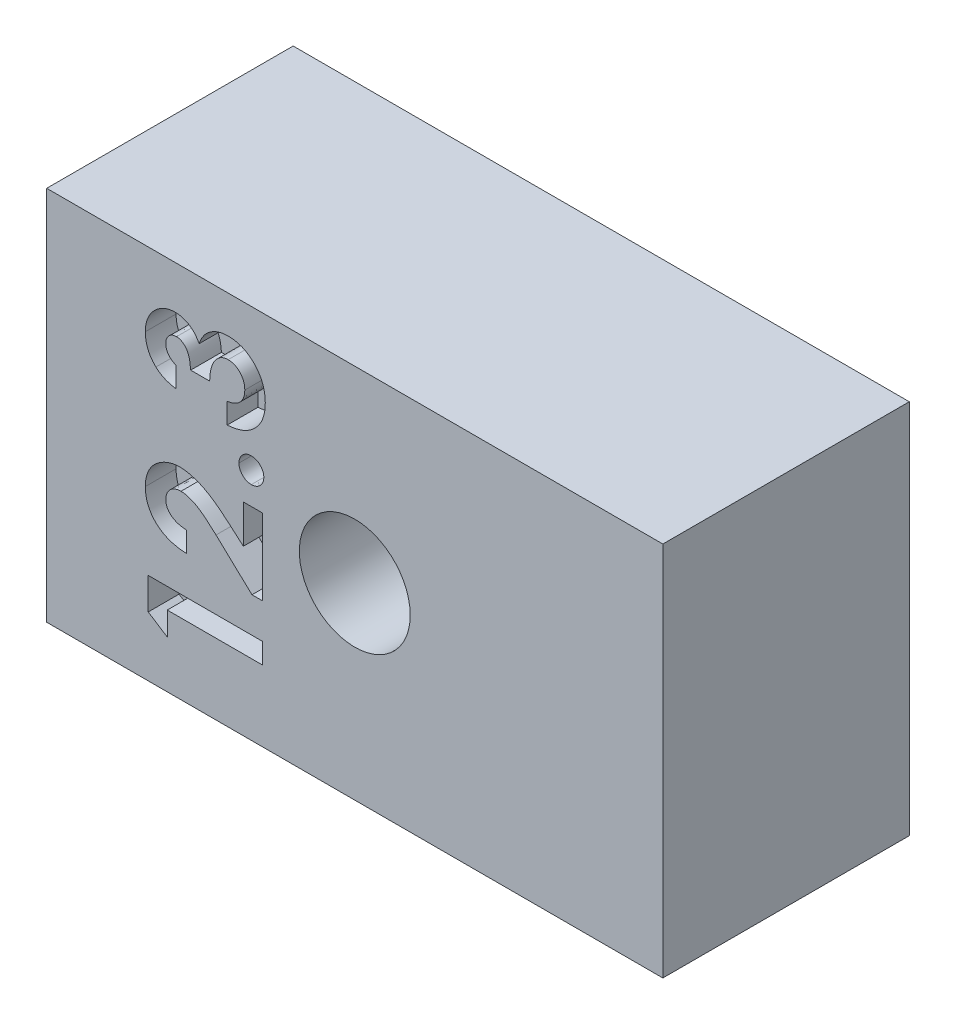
from build123d import *

# Parameters (mm, degrees)
SKETCH1_W           = 20
SKETCH1_H           = 12.2
SKETCH1_R           = 1.8
BOSS_EXTRUDE1_DEPTH = 8
CUT_EXTRUDE1_DEPTH  = 1


with BuildPart() as part:
    # Sketch1 → Boss-Extrude1 (new body)
    with BuildSketch(Plane.XY):
        with Locations((-2.245418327, 0.429083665)):
            Rectangle(SKETCH1_W, SKETCH1_H)
        with Locations((-2.245418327, 0.429083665)):
            Circle(SKETCH1_R, mode=Mode.SUBTRACT)
    extrude(amount=BOSS_EXTRUDE1_DEPTH)

    # Sketch3 → Cut-Extrude1 (cut)
    with BuildSketch(Plane.XY.offset(8)):
        Polygon((-8.949584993, -3.732909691), (-8.949584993, -2.705211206), (-5.245418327, -2.705211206), (-5.245418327, -3.370061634), (-8.332223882, -3.370061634), (-8.332223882, -4.129890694), align=None)
        with BuildLine():
            Line((-7.714862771, -0.805638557), (-7.714862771, -1.470488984))
            add(Edge.make_bspline(
                [(-7.714862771, -1.470488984), (-7.765155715, -1.467618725), (-7.863425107, -1.462010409), (-8.006155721, -1.439677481), (-8.141053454, -1.409829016), (-8.267712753, -1.369652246), (-8.38618683, -1.32016554), (-8.496083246, -1.260137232), (-8.59818946, -1.191359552), (-8.690714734, -1.112446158), (-8.773897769, -1.026599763), (-8.846618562, -0.934040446), (-8.907495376, -0.835031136), (-8.957432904, -0.730233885), (-8.997389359, -0.620060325), (-9.024089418, -0.503397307), (-9.042174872, -0.38127423), (-9.043757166, -0.297670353), (-9.044563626, -0.255059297)],
                knots=[0, 0, 0, 0, 1.198928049, 2.342633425, 3.435730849, 4.486331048, 5.502589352, 6.488331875, 7.46361919, 8.428949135, 9.378681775, 10.305958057, 11.226249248, 12.140413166, 13.066341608, 14.010670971, 14.986082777, 16, 16, 16, 16], degree=3))
            add(Edge.make_bspline(
                [(-9.044563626, -0.255059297), (-9.0430413, -0.202731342), (-9.040068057, -0.100530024), (-9.011353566, 0.04748298), (-8.967382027, 0.186458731), (-8.903497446, 0.314918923), (-8.822938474, 0.43264021), (-8.726698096, 0.538968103), (-8.613607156, 0.631828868), (-8.486922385, 0.710498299), (-8.352513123, 0.775553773), (-8.213782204, 0.821579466), (-8.07431021, 0.851672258), (-7.980407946, 0.854889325), (-7.933758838, 0.856487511)],
                knots=[0, 0, 0, 0, 1.075374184, 2.100304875, 3.089917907, 4.066149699, 5.039978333, 6.01615708, 7.006437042, 8.039858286, 9.077679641, 10.07047942, 11.041445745, 12, 12, 12, 12], degree=3))
            add(Edge.make_bspline(
                [(-7.933758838, 0.856487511), (-7.905541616, 0.85586606), (-7.848747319, 0.854615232), (-7.762803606, 0.84591806), (-7.67525989, 0.83287058), (-7.586191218, 0.813198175), (-7.495572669, 0.788665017), (-7.403132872, 0.758902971), (-7.309396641, 0.723220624), (-7.213306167, 0.682217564), (-7.11456081, 0.633287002), (-7.011633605, 0.576370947), (-6.904634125, 0.509566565), (-6.792512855, 0.43504854), (-6.676981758, 0.349885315), (-6.556757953, 0.256332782), (-6.432030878, 0.153920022), (-6.348620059, 0.081290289), (-6.305765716, 0.043974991)],
                knots=[0, 0, 0, 0, 0.728277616, 1.465842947, 2.227925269, 3.011838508, 3.818735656, 4.650581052, 5.517389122, 6.406849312, 7.346234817, 8.360743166, 9.441530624, 10.601362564, 11.834937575, 13.145232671, 14.533293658, 16, 16, 16, 16], degree=3))
            Line((-6.305765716, 0.043974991), (-5.862779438, -0.342617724))
            Line((-5.862779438, -0.342617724), (-5.862779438, 0.903976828))
            Line((-5.862779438, 0.903976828), (-5.245418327, 0.903976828))
            Line((-5.245418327, 0.903976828), (-5.245418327, -1.565467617))
            Line((-5.245418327, -1.565467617), (-5.582295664, -1.565467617))
            Line((-5.582295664, -1.565467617), (-6.749494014, -0.46876122))
            add(Edge.make_bspline(
                [(-6.749494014, -0.46876122), (-6.783541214, -0.437008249), (-6.849480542, -0.37551216), (-6.946324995, -0.288017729), (-7.038208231, -0.208813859), (-7.126195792, -0.139671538), (-7.207308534, -0.076407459), (-7.28461283, -0.023482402), (-7.355931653, 0.022608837), (-7.442866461, 0.070756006), (-7.545768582, 0.117532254), (-7.664242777, 0.160425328), (-7.777556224, 0.186309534), (-7.851525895, 0.189909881), (-7.887011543, 0.191637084)],
                knots=[0, 0, 0, 0, 1.246192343, 2.413505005, 3.49357156, 4.492416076, 5.408771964, 6.246246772, 6.999304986, 7.680960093, 8.904522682, 10.020616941, 11.0504258, 12, 12, 12, 12], degree=3))
            add(Edge.make_bspline(
                [(-7.887011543, 0.191637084), (-7.921342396, 0.190349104), (-7.987863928, 0.187853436), (-8.082490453, 0.160428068), (-8.168165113, 0.117939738), (-8.24232785, 0.058067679), (-8.303272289, -0.014456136), (-8.348601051, -0.098264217), (-8.374755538, -0.192673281), (-8.378029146, -0.258855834), (-8.379713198, -0.292902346)],
                knots=[0, 0, 0, 0, 1.062038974, 2.057870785, 3.028805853, 4.01125022, 4.991535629, 5.949134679, 6.94496649, 8, 8, 8, 8], degree=3))
            add(Edge.make_bspline(
                [(-8.379713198, -0.292902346), (-8.379091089, -0.310491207), (-8.377866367, -0.345117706), (-8.369713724, -0.396015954), (-8.355345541, -0.444449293), (-8.336094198, -0.490956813), (-8.310576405, -0.535042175), (-8.27912166, -0.576594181), (-8.242529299, -0.616050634), (-8.200913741, -0.653230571), (-8.154470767, -0.687069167), (-8.103624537, -0.717124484), (-8.048406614, -0.741975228), (-7.989545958, -0.763854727), (-7.926410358, -0.780729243), (-7.859377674, -0.793015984), (-7.788556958, -0.802356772), (-7.739874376, -0.804524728), (-7.714862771, -0.805638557)],
                knots=[0, 0, 0, 0, 0.903469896, 1.778625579, 2.63899355, 3.493148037, 4.358286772, 5.247621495, 6.164656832, 7.118446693, 8.109501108, 9.111810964, 10.146451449, 11.215617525, 12.33435995, 13.498009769, 14.714554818, 16, 16, 16, 16], degree=3))
        make_face()
        with BuildLine():
            add(Edge.make_bspline(
                [(-6.005247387, 1.924997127), (-6.003873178, 1.951869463), (-6.001164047, 2.004845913), (-5.978134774, 2.08066888), (-5.940630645, 2.150168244), (-5.889662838, 2.211504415), (-5.828804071, 2.263650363), (-5.759260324, 2.301291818), (-5.683212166, 2.32474337), (-5.630203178, 2.327331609), (-5.60307224, 2.328656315)],
                knots=[0, 0, 0, 0, 1.01719242, 2.005305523, 2.97459142, 3.994072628, 5.012345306, 5.994342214, 6.97346883, 8, 8, 8, 8], degree=3))
            add(Edge.make_bspline(
                [(-5.60307224, 2.328656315), (-5.575951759, 2.327298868), (-5.522725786, 2.324634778), (-5.446312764, 2.301491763), (-5.376522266, 2.263433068), (-5.314998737, 2.211572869), (-5.263396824, 2.150179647), (-5.224903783, 2.080871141), (-5.202057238, 2.004823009), (-5.199318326, 1.951861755), (-5.19792901, 1.924997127)],
                knots=[0, 0, 0, 0, 1.023125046, 2.0079595, 2.986698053, 4.008755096, 5.030812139, 6.001348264, 6.986182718, 8, 8, 8, 8], degree=3))
            add(Edge.make_bspline(
                [(-5.19792901, 1.924997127), (-5.199307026, 1.898126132), (-5.202023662, 1.845152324), (-5.2250964, 1.768986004), (-5.263139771, 1.699165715), (-5.315061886, 1.637757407), (-5.37630182, 1.585663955), (-5.44653763, 1.548672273), (-5.522696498, 1.525305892), (-5.575941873, 1.522677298), (-5.60307224, 1.521337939)],
                knots=[0, 0, 0, 0, 1.013339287, 1.99770941, 2.975986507, 3.997561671, 5.019136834, 5.992987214, 6.977357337, 8, 8, 8, 8], degree=3))
            add(Edge.make_bspline(
                [(-5.60307224, 1.521337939), (-5.630213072, 1.52264454), (-5.683241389, 1.525197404), (-5.75903667, 1.548869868), (-5.829023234, 1.585448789), (-5.889600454, 1.637824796), (-5.940885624, 1.699180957), (-5.977942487, 1.769185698), (-6.001197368, 1.845129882), (-6.003884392, 1.898118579), (-6.005247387, 1.924997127)],
                knots=[0, 0, 0, 0, 1.026040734, 2.004699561, 2.981785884, 3.999572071, 5.018566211, 5.995652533, 6.983293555, 8, 8, 8, 8], degree=3))
        make_face()
        with BuildLine():
            Line((-8.047287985, 3.65835717), (-8.047287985, 2.993506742))
            add(Edge.make_bspline(
                [(-8.047287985, 2.993506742), (-8.080528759, 2.998171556), (-8.145456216, 3.007283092), (-8.239679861, 3.029681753), (-8.329279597, 3.055584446), (-8.413774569, 3.088710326), (-8.493073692, 3.12694818), (-8.567247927, 3.171538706), (-8.637361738, 3.220412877), (-8.679378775, 3.258678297), (-8.700266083, 3.277700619)],
                knots=[0, 0, 0, 0, 1.1115466, 2.171125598, 3.205689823, 4.19946166, 5.17440286, 6.118867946, 7.064860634, 8, 8, 8, 8], degree=3))
            add(Edge.make_bspline(
                [(-8.700266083, 3.277700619), (-8.727867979, 3.305070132), (-8.782268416, 3.359012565), (-8.851949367, 3.449156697), (-8.912253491, 3.543644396), (-8.960063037, 3.644370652), (-8.998759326, 3.74976809), (-9.02475171, 3.860674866), (-9.041997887, 3.976637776), (-9.043696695, 4.055767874), (-9.044563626, 4.096149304)],
                knots=[0, 0, 0, 0, 1.01925491, 2.00884431, 2.983262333, 3.955970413, 4.92937149, 5.924503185, 6.940838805, 8, 8, 8, 8], degree=3))
            add(Edge.make_bspline(
                [(-9.044563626, 4.096149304), (-9.04371607, 4.132050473), (-9.042049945, 4.202624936), (-9.028675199, 4.30635164), (-9.005217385, 4.405246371), (-8.974546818, 4.500354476), (-8.932814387, 4.590277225), (-8.884371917, 4.6769993), (-8.824955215, 4.758097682), (-8.75782032, 4.833762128), (-8.68520736, 4.903274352), (-8.607590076, 4.963472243), (-8.527041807, 5.01522545), (-8.442893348, 5.057863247), (-8.35500231, 5.090645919), (-8.263876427, 5.113398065), (-8.169716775, 5.128289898), (-8.105717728, 5.129773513), (-8.073258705, 5.130525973)],
                knots=[0, 0, 0, 0, 1.091422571, 2.145516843, 3.172569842, 4.178562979, 5.178154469, 6.181868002, 7.194278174, 8.227918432, 9.254613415, 10.245994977, 11.209837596, 12.161663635, 13.10878368, 14.055455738, 15.013766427, 16, 16, 16, 16], degree=3))
            add(Edge.make_bspline(
                [(-8.073258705, 5.130525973), (-8.033068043, 5.12895215), (-7.95370261, 5.125844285), (-7.837773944, 5.101265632), (-7.72717721, 5.061754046), (-7.623222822, 5.005574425), (-7.52601907, 4.935025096), (-7.438960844, 4.848509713), (-7.360699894, 4.748442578), (-7.318641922, 4.673322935), (-7.297105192, 4.634856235)],
                knots=[0, 0, 0, 0, 0.992776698, 1.96045919, 2.915875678, 3.886951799, 4.871409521, 5.874469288, 6.911574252, 8, 8, 8, 8], degree=3))
            add(Edge.make_bspline(
                [(-7.297105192, 4.634856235), (-7.288437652, 4.661260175), (-7.271406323, 4.713142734), (-7.237842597, 4.786872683), (-7.201240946, 4.857039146), (-7.158512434, 4.922037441), (-7.112618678, 4.983649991), (-7.061092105, 5.039927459), (-7.005255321, 5.092327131), (-6.944514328, 5.139552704), (-6.879879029, 5.181774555), (-6.812511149, 5.218984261), (-6.742164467, 5.250210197), (-6.669355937, 5.276417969), (-6.593369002, 5.296413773), (-6.514461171, 5.310481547), (-6.432822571, 5.318615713), (-6.377512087, 5.319856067), (-6.349544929, 5.320483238)],
                knots=[0, 0, 0, 0, 1.059375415, 2.081625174, 3.086260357, 4.075579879, 5.045586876, 6.014170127, 6.982201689, 7.963705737, 8.945119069, 9.924852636, 10.896327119, 11.878239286, 12.873838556, 13.889973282, 14.933087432, 16, 16, 16, 16], degree=3))
            add(Edge.make_bspline(
                [(-6.349544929, 5.320483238), (-6.308444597, 5.319211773), (-6.227403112, 5.316704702), (-6.108037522, 5.300765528), (-5.994232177, 5.271090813), (-5.884681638, 5.232048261), (-5.780785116, 5.179984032), (-5.680215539, 5.118660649), (-5.586383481, 5.043598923), (-5.49748822, 4.959424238), (-5.416274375, 4.866431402), (-5.344521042, 4.766365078), (-5.285371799, 4.659031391), (-5.234814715, 4.547025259), (-5.197293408, 4.427823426), (-5.169816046, 4.302967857), (-5.153097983, 4.171546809), (-5.151338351, 4.081852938), (-5.150439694, 4.036045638)],
                knots=[0, 0, 0, 0, 1.005228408, 1.982105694, 2.937129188, 3.876607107, 4.82066901, 5.774063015, 6.75178259, 7.752926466, 8.764612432, 9.766578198, 10.757677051, 11.756882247, 12.76686714, 13.807379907, 14.880213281, 16, 16, 16, 16], degree=3))
            add(Edge.make_bspline(
                [(-5.150439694, 4.036045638), (-5.151385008, 3.992711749), (-5.153233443, 3.907978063), (-5.169232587, 3.784037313), (-5.195040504, 3.666243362), (-5.231418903, 3.554295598), (-5.27859547, 3.448627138), (-5.334772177, 3.348279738), (-5.403189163, 3.25525581), (-5.480757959, 3.168518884), (-5.567785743, 3.089993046), (-5.662256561, 3.019809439), (-5.764529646, 2.959515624), (-5.874168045, 2.908864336), (-5.991364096, 2.868251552), (-6.115879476, 2.836216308), (-6.247957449, 2.813839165), (-6.338829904, 2.80702416), (-6.385161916, 2.803549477)],
                knots=[0, 0, 0, 0, 1.066544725, 2.085487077, 3.070979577, 4.031932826, 4.977951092, 5.916076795, 6.857635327, 7.814973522, 8.776389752, 9.738577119, 10.707772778, 11.69409279, 12.707140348, 13.757286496, 14.856535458, 16, 16, 16, 16], degree=3))
            Line((-6.385161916, 2.803549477), (-6.385161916, 3.468399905))
            add(Edge.make_bspline(
                [(-6.385161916, 3.468399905), (-6.361865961, 3.472613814), (-6.316490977, 3.480821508), (-6.250791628, 3.496815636), (-6.190170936, 3.517713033), (-6.134183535, 3.541604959), (-6.082254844, 3.568020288), (-6.035773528, 3.599582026), (-5.992912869, 3.633423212), (-5.94364743, 3.684294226), (-5.891982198, 3.755270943), (-5.846225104, 3.851369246), (-5.820201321, 3.958757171), (-5.816963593, 4.033679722), (-5.815290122, 4.072404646)],
                knots=[0, 0, 0, 0, 0.928450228, 1.808400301, 2.64896863, 3.43999153, 4.194978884, 4.9294959, 5.640047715, 6.332896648, 7.70085756, 9.063442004, 10.482192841, 12, 12, 12, 12], degree=3))
            add(Edge.make_bspline(
                [(-5.815290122, 4.072404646), (-5.815644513, 4.092956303), (-5.816338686, 4.133212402), (-5.823962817, 4.192357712), (-5.836665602, 4.248644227), (-5.853460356, 4.302539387), (-5.876250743, 4.353196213), (-5.902698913, 4.401761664), (-5.935075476, 4.447347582), (-5.971965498, 4.48968841), (-6.011357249, 4.529093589), (-6.05446215, 4.562741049), (-6.099210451, 4.591790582), (-6.14678576, 4.614712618), (-6.195686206, 4.633896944), (-6.247466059, 4.645861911), (-6.30100136, 4.654841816), (-6.337632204, 4.655366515), (-6.356223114, 4.655632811)],
                knots=[0, 0, 0, 0, 1.110702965, 2.175618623, 3.217100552, 4.227908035, 5.221854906, 6.215531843, 7.213608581, 8.237687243, 9.249555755, 10.220750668, 11.188994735, 12.127982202, 13.071814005, 14.022160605, 14.996205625, 16, 16, 16, 16], degree=3))
            add(Edge.make_bspline(
                [(-6.356223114, 4.655632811), (-6.376562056, 4.654955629), (-6.416808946, 4.653615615), (-6.475788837, 4.64182356), (-6.532742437, 4.624172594), (-6.587199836, 4.598787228), (-6.638840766, 4.565569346), (-6.688092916, 4.525179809), (-6.734564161, 4.477253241), (-6.779607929, 4.423394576), (-6.819039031, 4.36143071), (-6.855349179, 4.293863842), (-6.884261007, 4.219029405), (-6.910078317, 4.138722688), (-6.928936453, 4.051433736), (-6.94262884, 3.957701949), (-6.952820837, 3.857679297), (-6.954283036, 3.788732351), (-6.955033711, 3.753335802)],
                knots=[0, 0, 0, 0, 0.809868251, 1.602574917, 2.388262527, 3.182133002, 3.988875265, 4.829537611, 5.714850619, 6.646378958, 7.622533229, 8.636771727, 9.698525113, 10.814716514, 11.996253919, 13.252421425, 14.589425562, 16, 16, 16, 16], degree=3))
            Line((-6.955033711, 3.753335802), (-7.572394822, 3.753335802))
            add(Edge.make_bspline(
                [(-7.572394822, 3.753335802), (-7.57613401, 3.797411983), (-7.583129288, 3.879869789), (-7.599718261, 3.99424693), (-7.621178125, 4.090865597), (-7.649146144, 4.170830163), (-7.681814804, 4.238327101), (-7.719666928, 4.296464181), (-7.763133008, 4.347187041), (-7.812149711, 4.388908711), (-7.863529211, 4.423677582), (-7.91817399, 4.447478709), (-7.973909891, 4.463431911), (-8.012060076, 4.464932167), (-8.030963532, 4.465675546)],
                knots=[0, 0, 0, 0, 1.700711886, 3.181695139, 4.441392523, 5.500267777, 6.431839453, 7.31822765, 8.161090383, 8.990537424, 9.787217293, 10.536619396, 11.274893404, 12, 12, 12, 12], degree=3))
            add(Edge.make_bspline(
                [(-8.030963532, 4.465675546), (-8.055084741, 4.464398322), (-8.102164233, 4.461905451), (-8.169665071, 4.44216475), (-8.230155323, 4.408663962), (-8.282958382, 4.363208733), (-8.326030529, 4.30736649), (-8.358065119, 4.242739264), (-8.376752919, 4.169654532), (-8.378704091, 4.118271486), (-8.379713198, 4.09169718)],
                knots=[0, 0, 0, 0, 1.009324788, 1.969988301, 2.915956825, 3.885795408, 4.868116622, 5.850437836, 6.888288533, 8, 8, 8, 8], degree=3))
            add(Edge.make_bspline(
                [(-8.379713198, 4.09169718), (-8.378527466, 4.06760771), (-8.376174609, 4.019806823), (-8.358613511, 3.949907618), (-8.329051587, 3.883526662), (-8.288287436, 3.822038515), (-8.239331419, 3.766330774), (-8.181353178, 3.72061079), (-8.11782629, 3.682583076), (-8.07089293, 3.666464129), (-8.047287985, 3.65835717)],
                knots=[0, 0, 0, 0, 0.98818071, 1.960853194, 2.938124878, 3.957524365, 4.978590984, 5.968022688, 6.978025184, 8, 8, 8, 8], degree=3))
        make_face()
    extrude(amount=-CUT_EXTRUDE1_DEPTH, mode=Mode.SUBTRACT)


solid = part.part
